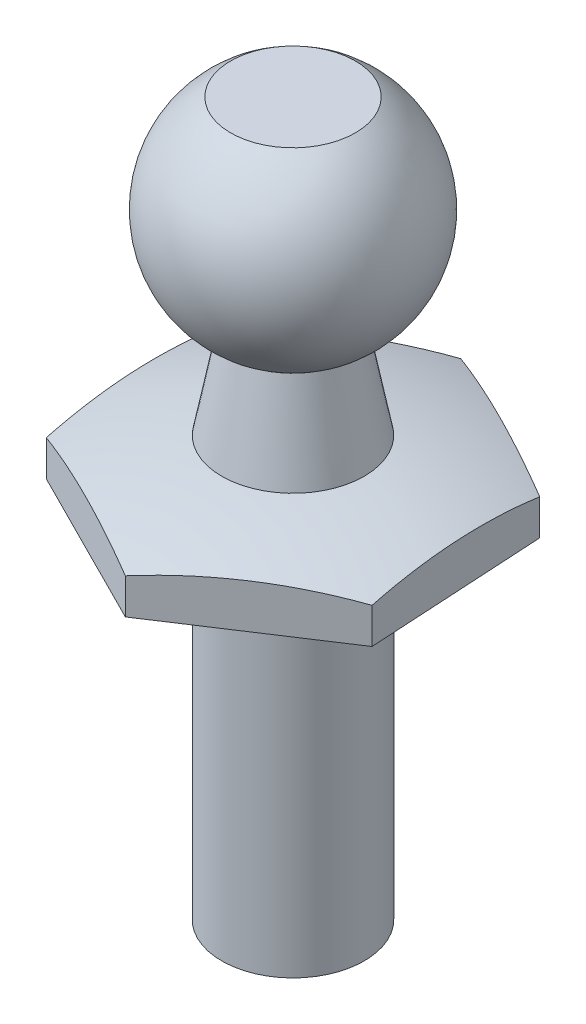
ISO-10303-21;
HEADER;
FILE_DESCRIPTION(('STEP AP214'),'2;1');
FILE_NAME('part.step','',(''),(''),'','','');
FILE_SCHEMA(('AUTOMOTIVE_DESIGN { 1 0 10303 214 1 1 1 1 }'));
ENDSEC;
DATA;
#1=APPLICATION_CONTEXT('core data for automotive mechanical design processes');
#2=APPLICATION_PROTOCOL_DEFINITION('international standard','automotive_design',2000,#1);
#3=PRODUCT_CONTEXT('',#1,'mechanical');
#4=PRODUCT('Part','Part','',(#3));
#5=PRODUCT_RELATED_PRODUCT_CATEGORY('part','',(#4));
#6=PRODUCT_DEFINITION_FORMATION('','',#4);
#7=PRODUCT_DEFINITION_CONTEXT('part definition',#1,'design');
#8=PRODUCT_DEFINITION('design','',#6,#7);
#9=PRODUCT_DEFINITION_SHAPE('','',#8);
#10=(LENGTH_UNIT() NAMED_UNIT(*) SI_UNIT(.MILLI.,.METRE.));
#11=(NAMED_UNIT(*) PLANE_ANGLE_UNIT() SI_UNIT($,.RADIAN.));
#12=(NAMED_UNIT(*) SI_UNIT($,.STERADIAN.) SOLID_ANGLE_UNIT());
#13=UNCERTAINTY_MEASURE_WITH_UNIT(LENGTH_MEASURE(1.E-05),#10,'distance_accuracy_value','');
#14=(GEOMETRIC_REPRESENTATION_CONTEXT(3) GLOBAL_UNCERTAINTY_ASSIGNED_CONTEXT((#13)) GLOBAL_UNIT_ASSIGNED_CONTEXT((#10,
#11,#12)) REPRESENTATION_CONTEXT('',''));
#15=CARTESIAN_POINT('',(0.,0.,0.));
#16=DIRECTION('',(0.,0.,1.));
#17=DIRECTION('',(1.,0.,0.));
#18=AXIS2_PLACEMENT_3D('',#15,#16,#17);
#19=CARTESIAN_POINT('',(0.,-24.153393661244,1.11022302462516E-13));
#20=DIRECTION('',(0.,1.,0.));
#21=DIRECTION('',(1.,0.,0.));
#22=AXIS2_PLACEMENT_3D('',#19,#20,#21);
#23=SPHERICAL_SURFACE('',#22,28.);
#24=CARTESIAN_POINT('',(-1.11022302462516E-13,3.559419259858,0.));
#25=DIRECTION('',(0.,1.,0.));
#26=DIRECTION('',(-1.,0.,0.));
#27=AXIS2_PLACEMENT_3D('',#24,#25,#26);
#28=CIRCLE('',#27,4.);
#29=CARTESIAN_POINT('',(-4.00000000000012,3.559419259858,0.));
#30=VERTEX_POINT('',#29);
#31=EDGE_CURVE('E143',#30,#30,#28,.T.);
#32=ORIENTED_EDGE('',*,*,#31,.F.);
#33=EDGE_LOOP('',(#32));
#34=FACE_BOUND('',#33,.T.);
#35=CARTESIAN_POINT('',(8.64604678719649,-24.153393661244,-0.495857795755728));
#36=DIRECTION('',(0.998359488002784,0.,-0.0572567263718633));
#37=DIRECTION('',(-0.0572567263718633,0.,-0.998359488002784));
#38=AXIS2_PLACEMENT_3D('',#35,#36,#37);
#39=CIRCLE('',#38,26.6270539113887);
#40=CARTESIAN_POINT('',(8.35976315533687,2.00000000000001,-5.48765523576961));
#41=VERTEX_POINT('',#40);
#42=CARTESIAN_POINT('',(8.93233041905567,1.99999999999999,4.49593964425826));
#43=VERTEX_POINT('',#42);
#44=EDGE_CURVE('E11',#41,#43,#39,.T.);
#45=ORIENTED_EDGE('',*,*,#44,.F.);
#46=CARTESIAN_POINT('',(3.8935979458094,-24.153393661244,-7.73562505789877));
#47=DIRECTION('',(0.449593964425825,0.,-0.893233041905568));
#48=DIRECTION('',(-0.893233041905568,0.,-0.449593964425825));
#49=AXIS2_PLACEMENT_3D('',#46,#47,#48);
#50=CIRCLE('',#49,26.6270539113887);
#51=CARTESIAN_POINT('',(-0.572567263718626,1.99999999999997,-9.98359488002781));
#52=VERTEX_POINT('',#51);
#53=EDGE_CURVE('E39',#52,#41,#50,.T.);
#54=ORIENTED_EDGE('',*,*,#53,.F.);
#55=CARTESIAN_POINT('',(-4.75244884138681,-24.1533936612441,-7.23976726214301));
#56=DIRECTION('',(-0.54876552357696,0.,-0.835976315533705));
#57=DIRECTION('',(-0.835976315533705,0.,0.54876552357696));
#58=AXIS2_PLACEMENT_3D('',#55,#56,#57);
#59=CIRCLE('',#58,26.6270539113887);
#60=CARTESIAN_POINT('',(-8.93233041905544,1.99999999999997,-4.49593964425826));
#61=VERTEX_POINT('',#60);
#62=EDGE_CURVE('E101',#61,#52,#59,.T.);
#63=ORIENTED_EDGE('',*,*,#62,.F.);
#64=CARTESIAN_POINT('',(-8.64604678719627,-24.153393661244,0.495857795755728));
#65=DIRECTION('',(-0.998359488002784,0.,0.0572567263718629));
#66=DIRECTION('',(0.0572567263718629,0.,0.998359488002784));
#67=AXIS2_PLACEMENT_3D('',#64,#65,#66);
#68=CIRCLE('',#67,26.6270539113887);
#69=CARTESIAN_POINT('',(-8.35976315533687,1.99999999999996,5.48765523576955));
#70=VERTEX_POINT('',#69);
#71=EDGE_CURVE('E99',#70,#61,#68,.T.);
#72=ORIENTED_EDGE('',*,*,#71,.F.);
#73=CARTESIAN_POINT('',(-3.89359794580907,-24.153393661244,7.73562505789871));
#74=DIRECTION('',(-0.449593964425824,0.,0.893233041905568));
#75=DIRECTION('',(0.893233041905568,0.,0.449593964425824));
#76=AXIS2_PLACEMENT_3D('',#73,#74,#75);
#77=CIRCLE('',#76,26.6270539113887);
#78=CARTESIAN_POINT('',(0.57256726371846,2.00000000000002,9.98359488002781));
#79=VERTEX_POINT('',#78);
#80=EDGE_CURVE('E85',#79,#70,#77,.T.);
#81=ORIENTED_EDGE('',*,*,#80,.F.);
#82=CARTESIAN_POINT('',(4.75244884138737,-24.153393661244,7.23976726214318));
#83=DIRECTION('',(0.54876552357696,0.,0.835976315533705));
#84=DIRECTION('',(0.835976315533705,0.,-0.54876552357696));
#85=AXIS2_PLACEMENT_3D('',#82,#83,#84);
#86=CIRCLE('',#85,26.6270539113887);
#87=EDGE_CURVE('E80',#43,#79,#86,.T.);
#88=ORIENTED_EDGE('',*,*,#87,.F.);
#89=EDGE_LOOP('',(#45,#54,#63,#72,#81,#88));
#90=FACE_BOUND('',#89,.T.);
#91=ADVANCED_FACE('F31',(#34,#90),#23,.T.);
#92=CARTESIAN_POINT('',(-1.11022302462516E-13,3.559419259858,0.));
#93=DIRECTION('',(0.,-1.,0.));
#94=DIRECTION('',(1.,0.,0.));
#95=AXIS2_PLACEMENT_3D('',#92,#93,#94);
#96=CONICAL_SURFACE('',#95,4.,0.190092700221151);
#97=CARTESIAN_POINT('',(-1.11022302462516E-13,8.75649312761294,0.));
#98=DIRECTION('',(0.,1.,0.));
#99=DIRECTION('',(-1.,0.,0.));
#100=AXIS2_PLACEMENT_3D('',#97,#98,#99);
#101=CIRCLE('',#100,3.);
#102=CARTESIAN_POINT('',(3.00000000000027,8.75649312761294,0.));
#103=VERTEX_POINT('',#102);
#104=EDGE_CURVE('E140',#103,#103,#101,.T.);
#105=ORIENTED_EDGE('',*,*,#104,.F.);
#106=EDGE_LOOP('',(#105));
#107=FACE_BOUND('',#106,.T.);
#108=ORIENTED_EDGE('',*,*,#31,.T.);
#109=EDGE_LOOP('',(#108));
#110=FACE_BOUND('',#109,.T.);
#111=ADVANCED_FACE('F162',(#107,#110),#96,.T.);
#112=CARTESIAN_POINT('',(2.22044604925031E-13,14.5227744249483,0.));
#113=DIRECTION('',(0.,1.,0.));
#114=DIRECTION('',(1.,0.,0.));
#115=AXIS2_PLACEMENT_3D('',#112,#113,#114);
#116=SPHERICAL_SURFACE('',#115,6.5);
#117=CARTESIAN_POINT('',(3.88578058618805E-13,20.,1.11022302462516E-13));
#118=DIRECTION('',(0.,1.,0.));
#119=DIRECTION('',(-1.,0.,0.));
#120=AXIS2_PLACEMENT_3D('',#117,#118,#119);
#121=CIRCLE('',#120,3.5);
#122=CARTESIAN_POINT('',(3.50000000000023,20.,0.));
#123=VERTEX_POINT('',#122);
#124=EDGE_CURVE('E137',#123,#123,#121,.T.);
#125=CARTESIAN_POINT('',(3.50000000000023,20.,0.));
#126=CARTESIAN_POINT('',(3.61943361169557,19.9236892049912,0.));
#127=CARTESIAN_POINT('',(3.73636293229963,19.8434608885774,0.));
#128=CARTESIAN_POINT('',(3.96473134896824,19.6755375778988,0.));
#129=CARTESIAN_POINT('',(4.07617044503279,19.587842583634,0.));
#130=CARTESIAN_POINT('',(4.29307677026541,19.4053542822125,0.));
#131=CARTESIAN_POINT('',(4.39854399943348,19.3105609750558,0.));
#132=CARTESIAN_POINT('',(4.6030567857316,19.1142833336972,0.));
#133=CARTESIAN_POINT('',(4.70210234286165,19.0127989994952,0.));
#134=CARTESIAN_POINT('',(4.89334776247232,18.8035729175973,0.));
#135=CARTESIAN_POINT('',(4.98554762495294,18.6958311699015,0.));
#136=CARTESIAN_POINT('',(5.16270736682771,18.4745512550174,0.));
#137=CARTESIAN_POINT('',(5.24766724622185,18.3610130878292,0.));
#138=CARTESIAN_POINT('',(5.40998358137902,18.1286259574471,0.));
#139=CARTESIAN_POINT('',(5.48734003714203,18.0097769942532,0.));
#140=CARTESIAN_POINT('',(5.63411864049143,17.7672766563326,0.));
#141=CARTESIAN_POINT('',(5.70354078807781,17.643625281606,0.));
#142=CARTESIAN_POINT('',(5.83415382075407,17.3920490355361,0.));
#143=CARTESIAN_POINT('',(5.89534470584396,17.2641241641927,0.));
#144=CARTESIAN_POINT('',(6.0092334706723,17.0045481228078,0.));
#145=CARTESIAN_POINT('',(6.06193135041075,16.8728969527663,0.));
#146=CARTESIAN_POINT('',(6.15860868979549,16.6064314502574,0.));
#147=CARTESIAN_POINT('',(6.20258814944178,16.4716171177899,0.));
#148=CARTESIAN_POINT('',(6.28164052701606,16.1994019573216,0.));
#149=CARTESIAN_POINT('',(6.31671344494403,16.0620011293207,0.));
#150=CARTESIAN_POINT('',(6.37780271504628,15.7852007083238,0.));
#151=CARTESIAN_POINT('',(6.40381906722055,15.6458011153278,0.));
#152=CARTESIAN_POINT('',(6.44668392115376,15.3655994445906,0.));
#153=CARTESIAN_POINT('',(6.46353242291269,15.2247973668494,0.));
#154=CARTESIAN_POINT('',(6.48798950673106,14.9423930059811,0.));
#155=CARTESIAN_POINT('',(6.4955980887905,14.8007907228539,0.));
#156=CARTESIAN_POINT('',(6.50154278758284,14.5173916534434,0.));
#157=CARTESIAN_POINT('',(6.49987890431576,14.3755948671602,0.));
#158=CARTESIAN_POINT('',(6.48728578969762,14.0924133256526,0.));
#159=CARTESIAN_POINT('',(6.47635655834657,13.9510285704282,0.));
#160=CARTESIAN_POINT('',(6.44527949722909,13.6692758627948,0.));
#161=CARTESIAN_POINT('',(6.42513166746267,13.5289079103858,0.));
#162=CARTESIAN_POINT('',(6.37570359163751,13.2497892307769,0.));
#163=CARTESIAN_POINT('',(6.34642334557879,13.1110385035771,0.));
#164=CARTESIAN_POINT('',(6.27885568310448,12.8357477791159,0.));
#165=CARTESIAN_POINT('',(6.24056826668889,12.6992077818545,0.));
#166=CARTESIAN_POINT('',(6.15515003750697,12.4289225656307,0.));
#167=CARTESIAN_POINT('',(6.10801922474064,12.2951773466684,0.));
#168=CARTESIAN_POINT('',(6.00511580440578,12.0310537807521,0.));
#169=CARTESIAN_POINT('',(5.94934319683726,11.9006754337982,0.));
#170=CARTESIAN_POINT('',(5.82939475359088,11.6438433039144,0.));
#171=CARTESIAN_POINT('',(5.76521891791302,11.5173895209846,0.));
#172=CARTESIAN_POINT('',(5.62873853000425,11.2689474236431,0.));
#173=CARTESIAN_POINT('',(5.55643397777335,11.1469591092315,0.));
#174=CARTESIAN_POINT('',(5.40400543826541,10.9079697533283,0.));
#175=CARTESIAN_POINT('',(5.32388145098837,10.7909687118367,0.));
#176=CARTESIAN_POINT('',(5.15615677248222,10.562454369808,0.));
#177=CARTESIAN_POINT('',(5.0685560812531,10.450941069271,0.));
#178=CARTESIAN_POINT('',(4.8862526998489,10.2338792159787,0.));
#179=CARTESIAN_POINT('',(4.79155000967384,10.1283306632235,0.));
#180=CARTESIAN_POINT('',(4.59544774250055,9.92364975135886,0.));
#181=CARTESIAN_POINT('',(4.49404816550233,9.8245173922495,0.));
#182=CARTESIAN_POINT('',(4.28498577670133,9.63309304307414,0.));
#183=CARTESIAN_POINT('',(4.17732296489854,9.54080105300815,0.));
#184=CARTESIAN_POINT('',(3.95619494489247,9.36345170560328,0.));
#185=CARTESIAN_POINT('',(3.84272973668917,9.27839434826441,0.));
#186=CARTESIAN_POINT('',(3.61048110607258,9.11588001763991,0.));
#187=CARTESIAN_POINT('',(3.49169768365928,9.03842304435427,0.));
#188=CARTESIAN_POINT('',(3.24932506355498,8.89143363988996,0.));
#189=CARTESIAN_POINT('',(3.12573586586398,8.82190120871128,0.));
#190=CARTESIAN_POINT('',(3.00000000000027,8.75649312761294,0.));
#191=B_SPLINE_CURVE_WITH_KNOTS('',3,(#125,#126,#127,#128,#129,#130,#131,#132,#133,#134,#135,
#136,#137,#138,#139,#140,#141,#142,#143,#144,#145,#146,#147,#148,#149,#150,#151,#152,#153,#154,
#155,#156,#157,#158,#159,#160,#161,#162,#163,#164,#165,#166,#167,#168,#169,#170,#171,#172,#173,
#174,#175,#176,#177,#178,#179,#180,#181,#182,#183,#184,#185,#186,#187,#188,#189,#190),
.UNSPECIFIED.,.F.,.F.,(4,2,2,2,2,2,2,2,2,2,2,2,2,2,2,2,2,2,2,2,2,2,2,2,2,2,2,2,2,2,2,2,4),(0.,
0.425116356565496,0.850232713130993,1.27534906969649,1.70046542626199,2.12558178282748,
2.55069813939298,2.97581449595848,3.40093085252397,3.82604720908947,4.25116356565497,
4.67627992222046,5.10139627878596,5.52651263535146,5.95162899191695,6.37674534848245,
6.80186170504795,7.22697806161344,7.65209441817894,8.07721077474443,8.50232713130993,
8.92744348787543,9.35255984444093,9.77767620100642,10.2027925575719,10.6279089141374,
11.0530252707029,11.4781416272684,11.9032579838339,12.3283743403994,12.7534906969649,
13.1786070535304,13.6037234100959),.UNSPECIFIED.);
#192=EDGE_CURVE('BSEAM168',#123,#103,#191,.T.);
#193=ORIENTED_EDGE('',*,*,#124,.F.);
#194=ORIENTED_EDGE('',*,*,#104,.T.);
#195=ORIENTED_EDGE('',*,*,#192,.T.);
#196=ORIENTED_EDGE('',*,*,#192,.F.);
#197=EDGE_LOOP('',(#193,#195,#194,#196));
#198=FACE_BOUND('',#197,.T.);
#199=ADVANCED_FACE('F168',(#198),#116,.T.);
#200=CARTESIAN_POINT('',(3.88578058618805E-13,20.,1.11022302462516E-13));
#201=DIRECTION('',(0.,-1.,0.));
#202=DIRECTION('',(1.,0.,0.));
#203=AXIS2_PLACEMENT_3D('',#200,#201,#202);
#204=PLANE('',#203);
#205=ORIENTED_EDGE('',*,*,#124,.T.);
#206=EDGE_LOOP('',(#205));
#207=FACE_BOUND('',#206,.T.);
#208=ADVANCED_FACE('F199',(#207),#204,.F.);
#209=CARTESIAN_POINT('',(8.35976315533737,20.,-5.48765523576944));
#210=DIRECTION('',(0.998359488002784,0.,-0.0572567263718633));
#211=DIRECTION('',(-0.0572567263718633,0.,-0.998359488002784));
#212=AXIS2_PLACEMENT_3D('',#209,#210,#211);
#213=PLANE('',#212);
#214=DIRECTION('',(-0.0572567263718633,0.,-0.998359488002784));
#215=VECTOR('',#214,1.);
#216=CARTESIAN_POINT('',(8.6591601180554,0.,-0.267206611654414));
#217=LINE('',#216,#215);
#218=CARTESIAN_POINT('',(8.93233041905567,0.,4.49593964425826));
#219=VERTEX_POINT('',#218);
#220=CARTESIAN_POINT('',(8.35976315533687,0.,-5.48765523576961));
#221=VERTEX_POINT('',#220);
#222=EDGE_CURVE('E118',#219,#221,#217,.T.);
#223=ORIENTED_EDGE('',*,*,#222,.T.);
#224=DIRECTION('',(0.,-1.,0.));
#225=VECTOR('',#224,1.);
#226=CARTESIAN_POINT('',(8.35976315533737,20.,-5.48765523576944));
#227=LINE('',#226,#225);
#228=EDGE_CURVE('E111',#41,#221,#227,.T.);
#229=ORIENTED_EDGE('',*,*,#228,.F.);
#230=ORIENTED_EDGE('',*,*,#44,.T.);
#231=DIRECTION('',(0.,-1.,0.));
#232=VECTOR('',#231,1.);
#233=CARTESIAN_POINT('',(8.93233041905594,20.,4.49593964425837));
#234=LINE('',#233,#232);
#235=EDGE_CURVE('E51',#43,#219,#234,.T.);
#236=ORIENTED_EDGE('',*,*,#235,.T.);
#237=EDGE_LOOP('',(#223,#229,#230,#236));
#238=FACE_BOUND('',#237,.T.);
#239=ADVANCED_FACE('F116',(#238),#213,.T.);
#240=CARTESIAN_POINT('',(-0.572567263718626,20.,-9.98359488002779));
#241=DIRECTION('',(0.449593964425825,0.,-0.893233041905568));
#242=DIRECTION('',(-0.893233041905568,0.,-0.449593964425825));
#243=AXIS2_PLACEMENT_3D('',#240,#241,#242);
#244=PLANE('',#243);
#245=DIRECTION('',(-0.893233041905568,0.,-0.449593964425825));
#246=VECTOR('',#245,1.);
#247=CARTESIAN_POINT('',(7.08505901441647,0.,-6.12925632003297));
#248=LINE('',#247,#246);
#249=CARTESIAN_POINT('',(-0.572567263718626,0.,-9.98359488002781));
#250=VERTEX_POINT('',#249);
#251=EDGE_CURVE('E134',#221,#250,#248,.T.);
#252=ORIENTED_EDGE('',*,*,#251,.T.);
#253=DIRECTION('',(0.,-1.,0.));
#254=VECTOR('',#253,1.);
#255=CARTESIAN_POINT('',(-0.572567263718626,20.,-9.98359488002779));
#256=LINE('',#255,#254);
#257=EDGE_CURVE('E114',#52,#250,#256,.T.);
#258=ORIENTED_EDGE('',*,*,#257,.F.);
#259=ORIENTED_EDGE('',*,*,#53,.T.);
#260=ORIENTED_EDGE('',*,*,#228,.T.);
#261=EDGE_LOOP('',(#252,#258,#259,#260));
#262=FACE_BOUND('',#261,.T.);
#263=ADVANCED_FACE('F110',(#262),#244,.T.);
#264=CARTESIAN_POINT('',(-8.93233041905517,20.,-4.49593964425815));
#265=DIRECTION('',(-0.54876552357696,0.,-0.835976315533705));
#266=DIRECTION('',(-0.835976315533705,0.,0.54876552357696));
#267=AXIS2_PLACEMENT_3D('',#264,#265,#266);
#268=PLANE('',#267);
#269=DIRECTION('',(-0.835976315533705,0.,0.54876552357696));
#270=VECTOR('',#269,1.);
#271=CARTESIAN_POINT('',(-1.95702324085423,0.,-9.0747871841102));
#272=LINE('',#271,#270);
#273=CARTESIAN_POINT('',(-8.93233041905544,0.,-4.49593964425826));
#274=VERTEX_POINT('',#273);
#275=EDGE_CURVE('E132',#250,#274,#272,.T.);
#276=ORIENTED_EDGE('',*,*,#275,.T.);
#277=DIRECTION('',(0.,-1.,0.));
#278=VECTOR('',#277,1.);
#279=CARTESIAN_POINT('',(-8.93233041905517,20.,-4.49593964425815));
#280=LINE('',#279,#278);
#281=EDGE_CURVE('E122',#61,#274,#280,.T.);
#282=ORIENTED_EDGE('',*,*,#281,.F.);
#283=ORIENTED_EDGE('',*,*,#62,.T.);
#284=ORIENTED_EDGE('',*,*,#257,.T.);
#285=EDGE_LOOP('',(#276,#282,#283,#284));
#286=FACE_BOUND('',#285,.T.);
#287=ADVANCED_FACE('F183',(#286),#268,.T.);
#288=CARTESIAN_POINT('',(-8.35976315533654,20.,5.48765523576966));
#289=DIRECTION('',(-0.998359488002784,0.,0.0572567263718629));
#290=DIRECTION('',(0.0572567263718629,0.,0.998359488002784));
#291=AXIS2_PLACEMENT_3D('',#288,#289,#290);
#292=PLANE('',#291);
#293=DIRECTION('',(0.0572567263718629,0.,0.998359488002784));
#294=VECTOR('',#293,1.);
#295=CARTESIAN_POINT('',(-8.6329334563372,0.,0.72450897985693));
#296=LINE('',#295,#294);
#297=CARTESIAN_POINT('',(-8.35976315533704,0.,5.48765523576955));
#298=VERTEX_POINT('',#297);
#299=EDGE_CURVE('E130',#274,#298,#296,.T.);
#300=ORIENTED_EDGE('',*,*,#299,.T.);
#301=DIRECTION('',(0.,-1.,0.));
#302=VECTOR('',#301,1.);
#303=CARTESIAN_POINT('',(-8.35976315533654,20.,5.48765523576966));
#304=LINE('',#303,#302);
#305=EDGE_CURVE('E95',#70,#298,#304,.T.);
#306=ORIENTED_EDGE('',*,*,#305,.F.);
#307=ORIENTED_EDGE('',*,*,#71,.T.);
#308=ORIENTED_EDGE('',*,*,#281,.T.);
#309=EDGE_LOOP('',(#300,#306,#307,#308));
#310=FACE_BOUND('',#309,.T.);
#311=ADVANCED_FACE('F186',(#310),#292,.T.);
#312=CARTESIAN_POINT('',(0.572567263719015,20.,9.98359488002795));
#313=DIRECTION('',(-0.449593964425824,0.,0.893233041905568));
#314=DIRECTION('',(0.893233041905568,0.,0.449593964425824));
#315=AXIS2_PLACEMENT_3D('',#312,#313,#314);
#316=PLANE('',#315);
#317=DIRECTION('',(0.893233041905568,0.,0.449593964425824));
#318=VECTOR('',#317,1.);
#319=CARTESIAN_POINT('',(-0.702136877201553,0.,9.3419937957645));
#320=LINE('',#319,#318);
#321=CARTESIAN_POINT('',(0.57256726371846,0.,9.98359488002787));
#322=VERTEX_POINT('',#321);
#323=EDGE_CURVE('E93',#298,#322,#320,.T.);
#324=ORIENTED_EDGE('',*,*,#323,.T.);
#325=DIRECTION('',(0.,-1.,0.));
#326=VECTOR('',#325,1.);
#327=CARTESIAN_POINT('',(0.572567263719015,20.,9.98359488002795));
#328=LINE('',#327,#326);
#329=EDGE_CURVE('E46',#79,#322,#328,.T.);
#330=ORIENTED_EDGE('',*,*,#329,.F.);
#331=ORIENTED_EDGE('',*,*,#80,.T.);
#332=ORIENTED_EDGE('',*,*,#305,.T.);
#333=EDGE_LOOP('',(#324,#330,#331,#332));
#334=FACE_BOUND('',#333,.T.);
#335=ADVANCED_FACE('F89',(#334),#316,.T.);
#336=CARTESIAN_POINT('',(8.93233041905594,20.,4.49593964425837));
#337=DIRECTION('',(0.54876552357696,0.,0.835976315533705));
#338=DIRECTION('',(0.835976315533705,0.,-0.54876552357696));
#339=AXIS2_PLACEMENT_3D('',#336,#337,#338);
#340=PLANE('',#339);
#341=DIRECTION('',(0.835976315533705,0.,-0.54876552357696));
#342=VECTOR('',#341,1.);
#343=CARTESIAN_POINT('',(7.54787444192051,0.,5.40474734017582));
#344=LINE('',#343,#342);
#345=EDGE_CURVE('E119',#322,#219,#344,.T.);
#346=ORIENTED_EDGE('',*,*,#345,.T.);
#347=ORIENTED_EDGE('',*,*,#235,.F.);
#348=ORIENTED_EDGE('',*,*,#87,.T.);
#349=ORIENTED_EDGE('',*,*,#329,.T.);
#350=EDGE_LOOP('',(#346,#347,#348,#349));
#351=FACE_BOUND('',#350,.T.);
#352=ADVANCED_FACE('F81',(#351),#340,.T.);
#353=CARTESIAN_POINT('',(0.,-20.,1.11022302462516E-13));
#354=DIRECTION('',(0.,1.,0.));
#355=DIRECTION('',(-1.,0.,0.));
#356=AXIS2_PLACEMENT_3D('',#353,#354,#355);
#357=PLANE('',#356);
#358=CARTESIAN_POINT('',(0.,-20.,1.11022302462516E-13));
#359=DIRECTION('',(0.,1.,0.));
#360=DIRECTION('',(-1.,0.,0.));
#361=AXIS2_PLACEMENT_3D('',#358,#359,#360);
#362=CIRCLE('',#361,4.);
#363=CARTESIAN_POINT('',(-3.99999999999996,-20.,1.10578213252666E-13));
#364=VERTEX_POINT('',#363);
#365=EDGE_CURVE('E86',#364,#364,#362,.T.);
#366=ORIENTED_EDGE('',*,*,#365,.F.);
#367=EDGE_LOOP('',(#366));
#368=FACE_BOUND('',#367,.T.);
#369=ADVANCED_FACE('F33',(#368),#357,.F.);
#370=CARTESIAN_POINT('',(2.22044604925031E-13,14.5227744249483,0.));
#371=DIRECTION('',(0.,1.,0.));
#372=DIRECTION('',(-1.,0.,0.));
#373=AXIS2_PLACEMENT_3D('',#370,#371,#372);
#374=CYLINDRICAL_SURFACE('',#373,4.);
#375=CARTESIAN_POINT('',(0.,0.,0.));
#376=DIRECTION('',(0.,1.,0.));
#377=DIRECTION('',(-1.,0.,0.));
#378=AXIS2_PLACEMENT_3D('',#375,#376,#377);
#379=CIRCLE('',#378,4.);
#380=CARTESIAN_POINT('',(-4.00000000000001,0.,0.));
#381=VERTEX_POINT('',#380);
#382=EDGE_CURVE('E146',#381,#381,#379,.T.);
#383=ORIENTED_EDGE('',*,*,#382,.F.);
#384=EDGE_LOOP('',(#383));
#385=FACE_BOUND('',#384,.T.);
#386=ORIENTED_EDGE('',*,*,#365,.T.);
#387=EDGE_LOOP('',(#386));
#388=FACE_BOUND('',#387,.T.);
#389=ADVANCED_FACE('F151',(#385,#388),#374,.T.);
#390=CARTESIAN_POINT('',(3.99999999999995,0.,0.));
#391=DIRECTION('',(0.,1.,0.));
#392=DIRECTION('',(-1.,0.,0.));
#393=AXIS2_PLACEMENT_3D('',#390,#391,#392);
#394=PLANE('',#393);
#395=ORIENTED_EDGE('',*,*,#382,.T.);
#396=EDGE_LOOP('',(#395));
#397=FACE_BOUND('',#396,.T.);
#398=ORIENTED_EDGE('',*,*,#222,.F.);
#399=ORIENTED_EDGE('',*,*,#345,.F.);
#400=ORIENTED_EDGE('',*,*,#323,.F.);
#401=ORIENTED_EDGE('',*,*,#299,.F.);
#402=ORIENTED_EDGE('',*,*,#275,.F.);
#403=ORIENTED_EDGE('',*,*,#251,.F.);
#404=EDGE_LOOP('',(#398,#399,#400,#401,#402,#403));
#405=FACE_BOUND('',#404,.T.);
#406=ADVANCED_FACE('F158',(#397,#405),#394,.F.);
#407=CLOSED_SHELL('',(#91,#111,#199,#208,#239,#263,#287,#311,#335,#352,#369,#389,#406));
#408=MANIFOLD_SOLID_BREP('B2',#407);
#409=ADVANCED_BREP_SHAPE_REPRESENTATION('',(#18,#408),#14);
#410=SHAPE_DEFINITION_REPRESENTATION(#9,#409);
ENDSEC;
END-ISO-10303-21;
